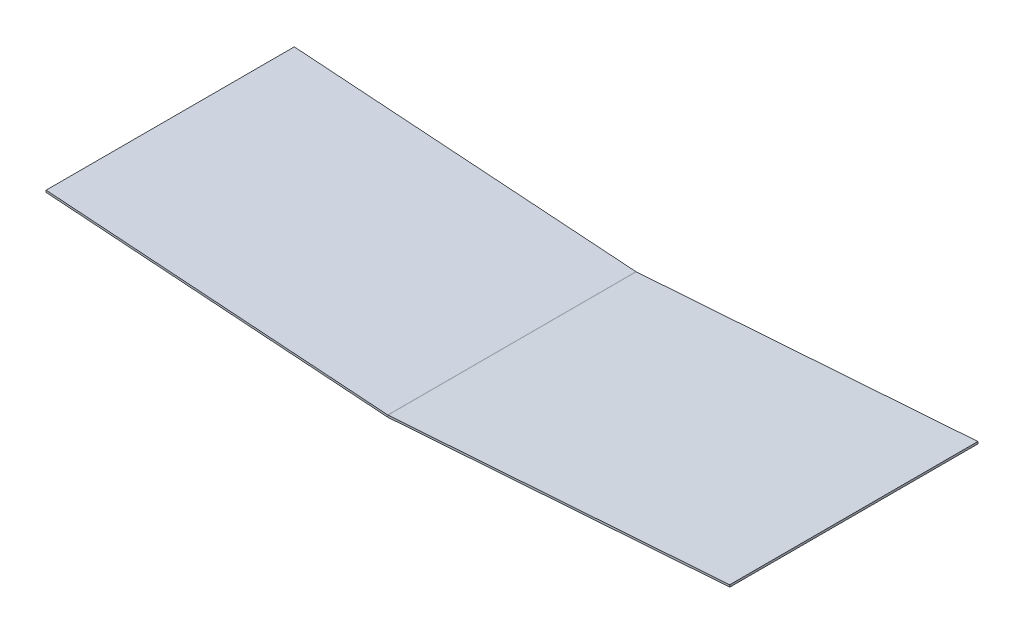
ISO-10303-21;
HEADER;
FILE_DESCRIPTION(('STEP AP214'),'2;1');
FILE_NAME('part.step','',(''),(''),'','','');
FILE_SCHEMA(('AUTOMOTIVE_DESIGN { 1 0 10303 214 1 1 1 1 }'));
ENDSEC;
DATA;
#1=APPLICATION_CONTEXT('core data for automotive mechanical design processes');
#2=APPLICATION_PROTOCOL_DEFINITION('international standard','automotive_design',2000,#1);
#3=PRODUCT_CONTEXT('',#1,'mechanical');
#4=PRODUCT('Part','Part','',(#3));
#5=PRODUCT_RELATED_PRODUCT_CATEGORY('part','',(#4));
#6=PRODUCT_DEFINITION_FORMATION('','',#4);
#7=PRODUCT_DEFINITION_CONTEXT('part definition',#1,'design');
#8=PRODUCT_DEFINITION('design','',#6,#7);
#9=PRODUCT_DEFINITION_SHAPE('','',#8);
#10=(LENGTH_UNIT() NAMED_UNIT(*) SI_UNIT(.MILLI.,.METRE.));
#11=(NAMED_UNIT(*) PLANE_ANGLE_UNIT() SI_UNIT($,.RADIAN.));
#12=(NAMED_UNIT(*) SI_UNIT($,.STERADIAN.) SOLID_ANGLE_UNIT());
#13=UNCERTAINTY_MEASURE_WITH_UNIT(LENGTH_MEASURE(1.E-05),#10,'distance_accuracy_value','');
#14=(GEOMETRIC_REPRESENTATION_CONTEXT(3) GLOBAL_UNCERTAINTY_ASSIGNED_CONTEXT((#13)) GLOBAL_UNIT_ASSIGNED_CONTEXT((#10,
#11,#12)) REPRESENTATION_CONTEXT('',''));
#15=CARTESIAN_POINT('',(0.,0.,0.));
#16=DIRECTION('',(0.,0.,1.));
#17=DIRECTION('',(1.,0.,0.));
#18=AXIS2_PLACEMENT_3D('',#15,#16,#17);
#19=CARTESIAN_POINT('',(-0.885907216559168,0.0619486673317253,785.8125));
#20=DIRECTION('',(0.,0.,1.));
#21=DIRECTION('',(1.,0.,0.));
#22=AXIS2_PLACEMENT_3D('',#19,#20,#21);
#23=PLANE('',#22);
#24=DIRECTION('',(0.0697564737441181,0.997564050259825,0.));
#25=VECTOR('',#24,1.);
#26=CARTESIAN_POINT('',(-0.885907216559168,0.0619486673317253,785.8125));
#27=LINE('',#26,#25);
#28=CARTESIAN_POINT('',(-0.885907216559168,0.0619486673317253,785.8125));
#29=VERTEX_POINT('',#28);
#30=CARTESIAN_POINT('',(-0.442953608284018,6.39648038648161,785.8125));
#31=VERTEX_POINT('',#30);
#32=EDGE_CURVE('E11',#29,#31,#27,.T.);
#33=ORIENTED_EDGE('',*,*,#32,.F.);
#34=CARTESIAN_POINT('',(-8.91029871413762E-12,12.7310121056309,785.8125));
#35=DIRECTION('',(0.,0.,1.));
#36=DIRECTION('',(1.,0.,0.));
#37=AXIS2_PLACEMENT_3D('',#34,#35,#36);
#38=CIRCLE('',#37,12.7);
#39=CARTESIAN_POINT('',(0.885907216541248,0.0619486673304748,785.8125));
#40=VERTEX_POINT('',#39);
#41=EDGE_CURVE('E136',#40,#29,#38,.F.);
#42=ORIENTED_EDGE('',*,*,#41,.F.);
#43=DIRECTION('',(0.0697564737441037,-0.997564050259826,0.));
#44=VECTOR('',#43,1.);
#45=CARTESIAN_POINT('',(0.442953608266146,6.39648038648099,785.8125));
#46=LINE('',#45,#44);
#47=CARTESIAN_POINT('',(0.442953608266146,6.39648038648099,785.8125));
#48=VERTEX_POINT('',#47);
#49=EDGE_CURVE('E47',#48,#40,#46,.T.);
#50=ORIENTED_EDGE('',*,*,#49,.F.);
#51=CARTESIAN_POINT('',(-8.91029871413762E-12,12.7310121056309,785.8125));
#52=DIRECTION('',(0.,0.,-1.));
#53=DIRECTION('',(-1.,0.,0.));
#54=AXIS2_PLACEMENT_3D('',#51,#52,#53);
#55=CIRCLE('',#54,6.35);
#56=EDGE_CURVE('E188',#48,#31,#55,.T.);
#57=ORIENTED_EDGE('',*,*,#56,.T.);
#58=EDGE_LOOP('',(#33,#42,#50,#57));
#59=FACE_BOUND('',#58,.T.);
#60=ADVANCED_FACE('F39',(#59),#23,.T.);
#61=CARTESIAN_POINT('',(0.442953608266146,6.39648038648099,785.8125));
#62=DIRECTION('',(0.,0.,1.));
#63=DIRECTION('',(1.,0.,0.));
#64=AXIS2_PLACEMENT_3D('',#61,#62,#63);
#65=PLANE('',#64);
#66=DIRECTION('',(-0.997564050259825,0.0697564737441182,0.));
#67=VECTOR('',#66,1.);
#68=CARTESIAN_POINT('',(0.,0.,785.8125));
#69=LINE('',#68,#67);
#70=CARTESIAN_POINT('',(-1082.675,75.7080111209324,785.8125));
#71=VERTEX_POINT('',#70);
#72=EDGE_CURVE('E161',#29,#71,#69,.T.);
#73=ORIENTED_EDGE('',*,*,#72,.F.);
#74=ORIENTED_EDGE('',*,*,#32,.T.);
#75=DIRECTION('',(-0.997564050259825,0.0697564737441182,0.));
#76=VECTOR('',#75,1.);
#77=CARTESIAN_POINT('',(0.44295360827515,6.33453171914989,785.8125));
#78=LINE('',#77,#76);
#79=CARTESIAN_POINT('',(-1082.23204639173,82.0425428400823,785.8125));
#80=VERTEX_POINT('',#79);
#81=EDGE_CURVE('E204',#31,#80,#78,.T.);
#82=ORIENTED_EDGE('',*,*,#81,.T.);
#83=DIRECTION('',(-0.0697564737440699,-0.997564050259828,0.));
#84=VECTOR('',#83,1.);
#85=CARTESIAN_POINT('',(-1082.23204639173,82.0425428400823,785.8125));
#86=LINE('',#85,#84);
#87=EDGE_CURVE('E98',#80,#71,#86,.T.);
#88=ORIENTED_EDGE('',*,*,#87,.T.);
#89=EDGE_LOOP('',(#73,#74,#82,#88));
#90=FACE_BOUND('',#89,.T.);
#91=ADVANCED_FACE('F209',(#90),#65,.T.);
#92=CARTESIAN_POINT('',(0.885907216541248,0.0619486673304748,0.));
#93=DIRECTION('',(0.,0.,-1.));
#94=DIRECTION('',(-1.,0.,0.));
#95=AXIS2_PLACEMENT_3D('',#92,#93,#94);
#96=PLANE('',#95);
#97=DIRECTION('',(-0.0697564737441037,0.997564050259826,0.));
#98=VECTOR('',#97,1.);
#99=CARTESIAN_POINT('',(0.885907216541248,0.0619486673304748,0.));
#100=LINE('',#99,#98);
#101=CARTESIAN_POINT('',(0.885907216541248,0.0619486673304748,0.));
#102=VERTEX_POINT('',#101);
#103=CARTESIAN_POINT('',(0.442953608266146,6.39648038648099,0.));
#104=VERTEX_POINT('',#103);
#105=EDGE_CURVE('E82',#102,#104,#100,.T.);
#106=ORIENTED_EDGE('',*,*,#105,.F.);
#107=CARTESIAN_POINT('',(-8.91029871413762E-12,12.7310121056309,0.));
#108=DIRECTION('',(0.,0.,1.));
#109=DIRECTION('',(1.,0.,0.));
#110=AXIS2_PLACEMENT_3D('',#107,#108,#109);
#111=CIRCLE('',#110,12.7);
#112=CARTESIAN_POINT('',(-0.885907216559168,0.0619486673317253,0.));
#113=VERTEX_POINT('',#112);
#114=EDGE_CURVE('E159',#102,#113,#111,.F.);
#115=ORIENTED_EDGE('',*,*,#114,.T.);
#116=DIRECTION('',(-0.0697564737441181,-0.997564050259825,0.));
#117=VECTOR('',#116,1.);
#118=CARTESIAN_POINT('',(-0.442953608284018,6.39648038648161,0.));
#119=LINE('',#118,#117);
#120=CARTESIAN_POINT('',(-0.442953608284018,6.39648038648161,0.));
#121=VERTEX_POINT('',#120);
#122=EDGE_CURVE('E89',#121,#113,#119,.T.);
#123=ORIENTED_EDGE('',*,*,#122,.F.);
#124=CARTESIAN_POINT('',(-8.91029871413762E-12,12.7310121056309,0.));
#125=DIRECTION('',(0.,0.,-1.));
#126=DIRECTION('',(-1.,0.,0.));
#127=AXIS2_PLACEMENT_3D('',#124,#125,#126);
#128=CIRCLE('',#127,6.35);
#129=EDGE_CURVE('E150',#104,#121,#128,.T.);
#130=ORIENTED_EDGE('',*,*,#129,.F.);
#131=EDGE_LOOP('',(#106,#115,#123,#130));
#132=FACE_BOUND('',#131,.T.);
#133=ADVANCED_FACE('F189',(#132),#96,.T.);
#134=CARTESIAN_POINT('',(-0.442953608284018,6.39648038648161,0.));
#135=DIRECTION('',(0.,0.,-1.));
#136=DIRECTION('',(-1.,0.,0.));
#137=AXIS2_PLACEMENT_3D('',#134,#135,#136);
#138=PLANE('',#137);
#139=DIRECTION('',(-0.997564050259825,-0.0697564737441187,0.));
#140=VECTOR('',#139,1.);
#141=CARTESIAN_POINT('',(1082.675,75.7080111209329,0.));
#142=LINE('',#141,#140);
#143=CARTESIAN_POINT('',(1082.675,75.7080111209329,0.));
#144=VERTEX_POINT('',#143);
#145=EDGE_CURVE('E119',#144,#102,#142,.T.);
#146=ORIENTED_EDGE('',*,*,#145,.T.);
#147=ORIENTED_EDGE('',*,*,#105,.T.);
#148=DIRECTION('',(-0.997564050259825,-0.0697564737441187,0.));
#149=VECTOR('',#148,1.);
#150=CARTESIAN_POINT('',(1082.23204639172,82.0425428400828,0.));
#151=LINE('',#150,#149);
#152=CARTESIAN_POINT('',(1082.23204639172,82.0425428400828,0.));
#153=VERTEX_POINT('',#152);
#154=EDGE_CURVE('E153',#153,#104,#151,.T.);
#155=ORIENTED_EDGE('',*,*,#154,.F.);
#156=DIRECTION('',(-0.0697564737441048,0.997564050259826,0.));
#157=VECTOR('',#156,1.);
#158=CARTESIAN_POINT('',(1082.675,75.7080111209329,0.));
#159=LINE('',#158,#157);
#160=EDGE_CURVE('E156',#144,#153,#159,.T.);
#161=ORIENTED_EDGE('',*,*,#160,.F.);
#162=EDGE_LOOP('',(#146,#147,#155,#161));
#163=FACE_BOUND('',#162,.T.);
#164=ADVANCED_FACE('F179',(#163),#138,.T.);
#165=CARTESIAN_POINT('',(0.,0.,785.8125));
#166=DIRECTION('',(-0.0697564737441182,-0.997564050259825,0.));
#167=DIRECTION('',(0.997564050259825,-0.0697564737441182,0.));
#168=AXIS2_PLACEMENT_3D('',#165,#166,#167);
#169=PLANE('',#168);
#170=DIRECTION('',(-0.997564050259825,0.0697564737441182,0.));
#171=VECTOR('',#170,1.);
#172=CARTESIAN_POINT('',(0.,0.,0.));
#173=LINE('',#172,#171);
#174=CARTESIAN_POINT('',(-1082.675,75.7080111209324,0.));
#175=VERTEX_POINT('',#174);
#176=EDGE_CURVE('E143',#113,#175,#173,.T.);
#177=ORIENTED_EDGE('',*,*,#176,.F.);
#178=DIRECTION('',(0.,0.,-1.));
#179=VECTOR('',#178,1.);
#180=CARTESIAN_POINT('',(-0.885907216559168,0.0619486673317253,785.8125));
#181=LINE('',#180,#179);
#182=EDGE_CURVE('E162',#29,#113,#181,.T.);
#183=ORIENTED_EDGE('',*,*,#182,.F.);
#184=ORIENTED_EDGE('',*,*,#72,.T.);
#185=DIRECTION('',(0.,0.,-1.));
#186=VECTOR('',#185,1.);
#187=CARTESIAN_POINT('',(-1082.675,75.7080111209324,785.8125));
#188=LINE('',#187,#186);
#189=EDGE_CURVE('E139',#71,#175,#188,.T.);
#190=ORIENTED_EDGE('',*,*,#189,.T.);
#191=EDGE_LOOP('',(#177,#183,#184,#190));
#192=FACE_BOUND('',#191,.T.);
#193=ADVANCED_FACE('F195',(#192),#169,.T.);
#194=CARTESIAN_POINT('',(-8.91029871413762E-12,12.7310121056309,785.8125));
#195=DIRECTION('',(0.,0.,-1.));
#196=DIRECTION('',(-1.,0.,0.));
#197=AXIS2_PLACEMENT_3D('',#194,#195,#196);
#198=CYLINDRICAL_SURFACE('',#197,12.7);
#199=ORIENTED_EDGE('',*,*,#114,.F.);
#200=DIRECTION('',(0.,0.,-1.));
#201=VECTOR('',#200,1.);
#202=CARTESIAN_POINT('',(0.885907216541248,0.0619486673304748,785.8125));
#203=LINE('',#202,#201);
#204=EDGE_CURVE('E122',#40,#102,#203,.T.);
#205=ORIENTED_EDGE('',*,*,#204,.F.);
#206=ORIENTED_EDGE('',*,*,#41,.T.);
#207=ORIENTED_EDGE('',*,*,#182,.T.);
#208=EDGE_LOOP('',(#199,#205,#206,#207));
#209=FACE_BOUND('',#208,.T.);
#210=ADVANCED_FACE('F191',(#209),#198,.T.);
#211=CARTESIAN_POINT('',(1082.675,75.7080111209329,785.8125));
#212=DIRECTION('',(0.0697564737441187,-0.997564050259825,0.));
#213=DIRECTION('',(0.997564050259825,0.0697564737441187,0.));
#214=AXIS2_PLACEMENT_3D('',#211,#212,#213);
#215=PLANE('',#214);
#216=ORIENTED_EDGE('',*,*,#145,.F.);
#217=DIRECTION('',(0.,0.,-1.));
#218=VECTOR('',#217,1.);
#219=CARTESIAN_POINT('',(1082.675,75.7080111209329,785.8125));
#220=LINE('',#219,#218);
#221=CARTESIAN_POINT('',(1082.675,75.7080111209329,785.8125));
#222=VERTEX_POINT('',#221);
#223=EDGE_CURVE('E113',#222,#144,#220,.T.);
#224=ORIENTED_EDGE('',*,*,#223,.F.);
#225=DIRECTION('',(-0.997564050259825,-0.0697564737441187,0.));
#226=VECTOR('',#225,1.);
#227=CARTESIAN_POINT('',(1082.675,75.7080111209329,785.8125));
#228=LINE('',#227,#226);
#229=EDGE_CURVE('E117',#222,#40,#228,.T.);
#230=ORIENTED_EDGE('',*,*,#229,.T.);
#231=ORIENTED_EDGE('',*,*,#204,.T.);
#232=EDGE_LOOP('',(#216,#224,#230,#231));
#233=FACE_BOUND('',#232,.T.);
#234=ADVANCED_FACE('F115',(#233),#215,.T.);
#235=CARTESIAN_POINT('',(1082.675,75.7080111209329,785.8125));
#236=DIRECTION('',(-0.997564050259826,-0.0697564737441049,0.));
#237=DIRECTION('',(0.0697564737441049,-0.997564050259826,0.));
#238=AXIS2_PLACEMENT_3D('',#235,#236,#237);
#239=PLANE('',#238);
#240=ORIENTED_EDGE('',*,*,#160,.T.);
#241=DIRECTION('',(0.,0.,-1.));
#242=VECTOR('',#241,1.);
#243=CARTESIAN_POINT('',(1082.23204639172,82.0425428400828,785.8125));
#244=LINE('',#243,#242);
#245=CARTESIAN_POINT('',(1082.23204639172,82.0425428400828,785.8125));
#246=VERTEX_POINT('',#245);
#247=EDGE_CURVE('E123',#246,#153,#244,.T.);
#248=ORIENTED_EDGE('',*,*,#247,.F.);
#249=DIRECTION('',(-0.0697564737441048,0.997564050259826,0.));
#250=VECTOR('',#249,1.);
#251=CARTESIAN_POINT('',(1082.675,75.7080111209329,785.8125));
#252=LINE('',#251,#250);
#253=EDGE_CURVE('E126',#222,#246,#252,.T.);
#254=ORIENTED_EDGE('',*,*,#253,.F.);
#255=ORIENTED_EDGE('',*,*,#223,.T.);
#256=EDGE_LOOP('',(#240,#248,#254,#255));
#257=FACE_BOUND('',#256,.T.);
#258=ADVANCED_FACE('F127',(#257),#239,.F.);
#259=CARTESIAN_POINT('',(1082.23204639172,82.0425428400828,785.8125));
#260=DIRECTION('',(0.0697564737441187,-0.997564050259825,0.));
#261=DIRECTION('',(0.997564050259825,0.0697564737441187,0.));
#262=AXIS2_PLACEMENT_3D('',#259,#260,#261);
#263=PLANE('',#262);
#264=ORIENTED_EDGE('',*,*,#154,.T.);
#265=DIRECTION('',(0.,0.,-1.));
#266=VECTOR('',#265,1.);
#267=CARTESIAN_POINT('',(0.442953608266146,6.39648038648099,785.8125));
#268=LINE('',#267,#266);
#269=EDGE_CURVE('E166',#48,#104,#268,.T.);
#270=ORIENTED_EDGE('',*,*,#269,.F.);
#271=DIRECTION('',(-0.997564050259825,-0.0697564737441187,0.));
#272=VECTOR('',#271,1.);
#273=CARTESIAN_POINT('',(1082.23204639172,82.0425428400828,785.8125));
#274=LINE('',#273,#272);
#275=EDGE_CURVE('E132',#246,#48,#274,.T.);
#276=ORIENTED_EDGE('',*,*,#275,.F.);
#277=ORIENTED_EDGE('',*,*,#247,.T.);
#278=EDGE_LOOP('',(#264,#270,#276,#277));
#279=FACE_BOUND('',#278,.T.);
#280=ADVANCED_FACE('F183',(#279),#263,.F.);
#281=CARTESIAN_POINT('',(-8.91029871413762E-12,12.7310121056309,785.8125));
#282=DIRECTION('',(0.,0.,-1.));
#283=DIRECTION('',(-1.,0.,0.));
#284=AXIS2_PLACEMENT_3D('',#281,#282,#283);
#285=CYLINDRICAL_SURFACE('',#284,6.35);
#286=ORIENTED_EDGE('',*,*,#129,.T.);
#287=DIRECTION('',(0.,0.,-1.));
#288=VECTOR('',#287,1.);
#289=CARTESIAN_POINT('',(-0.442953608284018,6.39648038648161,785.8125));
#290=LINE('',#289,#288);
#291=EDGE_CURVE('E169',#31,#121,#290,.T.);
#292=ORIENTED_EDGE('',*,*,#291,.F.);
#293=ORIENTED_EDGE('',*,*,#56,.F.);
#294=ORIENTED_EDGE('',*,*,#269,.T.);
#295=EDGE_LOOP('',(#286,#292,#293,#294));
#296=FACE_BOUND('',#295,.T.);
#297=ADVANCED_FACE('F186',(#296),#285,.F.);
#298=CARTESIAN_POINT('',(0.44295360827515,6.33453171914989,785.8125));
#299=DIRECTION('',(-0.0697564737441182,-0.997564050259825,0.));
#300=DIRECTION('',(0.997564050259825,-0.0697564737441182,0.));
#301=AXIS2_PLACEMENT_3D('',#298,#299,#300);
#302=PLANE('',#301);
#303=DIRECTION('',(-0.997564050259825,0.0697564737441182,0.));
#304=VECTOR('',#303,1.);
#305=CARTESIAN_POINT('',(0.44295360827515,6.33453171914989,0.));
#306=LINE('',#305,#304);
#307=CARTESIAN_POINT('',(-1082.23204639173,82.0425428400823,0.));
#308=VERTEX_POINT('',#307);
#309=EDGE_CURVE('E148',#121,#308,#306,.T.);
#310=ORIENTED_EDGE('',*,*,#309,.T.);
#311=DIRECTION('',(0.,0.,-1.));
#312=VECTOR('',#311,1.);
#313=CARTESIAN_POINT('',(-1082.23204639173,82.0425428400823,785.8125));
#314=LINE('',#313,#312);
#315=EDGE_CURVE('E172',#80,#308,#314,.T.);
#316=ORIENTED_EDGE('',*,*,#315,.F.);
#317=ORIENTED_EDGE('',*,*,#81,.F.);
#318=ORIENTED_EDGE('',*,*,#291,.T.);
#319=EDGE_LOOP('',(#310,#316,#317,#318));
#320=FACE_BOUND('',#319,.T.);
#321=ADVANCED_FACE('F203',(#320),#302,.F.);
#322=CARTESIAN_POINT('',(-1082.23204639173,82.0425428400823,785.8125));
#323=DIRECTION('',(0.997564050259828,-0.0697564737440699,0.));
#324=DIRECTION('',(0.0697564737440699,0.997564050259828,0.));
#325=AXIS2_PLACEMENT_3D('',#322,#323,#324);
#326=PLANE('',#325);
#327=DIRECTION('',(-0.0697564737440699,-0.997564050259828,0.));
#328=VECTOR('',#327,1.);
#329=CARTESIAN_POINT('',(-1082.23204639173,82.0425428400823,0.));
#330=LINE('',#329,#328);
#331=EDGE_CURVE('E145',#308,#175,#330,.T.);
#332=ORIENTED_EDGE('',*,*,#331,.T.);
#333=ORIENTED_EDGE('',*,*,#189,.F.);
#334=ORIENTED_EDGE('',*,*,#87,.F.);
#335=ORIENTED_EDGE('',*,*,#315,.T.);
#336=EDGE_LOOP('',(#332,#333,#334,#335));
#337=FACE_BOUND('',#336,.T.);
#338=ADVANCED_FACE('F199',(#337),#326,.F.);
#339=CARTESIAN_POINT('',(-8.91029871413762E-12,12.7310121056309,785.8125));
#340=DIRECTION('',(0.,0.,-1.));
#341=DIRECTION('',(-1.,0.,0.));
#342=AXIS2_PLACEMENT_3D('',#339,#340,#341);
#343=PLANE('',#342);
#344=ORIENTED_EDGE('',*,*,#275,.T.);
#345=ORIENTED_EDGE('',*,*,#49,.T.);
#346=ORIENTED_EDGE('',*,*,#229,.F.);
#347=ORIENTED_EDGE('',*,*,#253,.T.);
#348=EDGE_LOOP('',(#344,#345,#346,#347));
#349=FACE_BOUND('',#348,.T.);
#350=ADVANCED_FACE('F134',(#349),#343,.F.);
#351=CARTESIAN_POINT('',(-8.91029871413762E-12,12.7310121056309,0.));
#352=DIRECTION('',(0.,0.,-1.));
#353=DIRECTION('',(-1.,0.,0.));
#354=AXIS2_PLACEMENT_3D('',#351,#352,#353);
#355=PLANE('',#354);
#356=ORIENTED_EDGE('',*,*,#176,.T.);
#357=ORIENTED_EDGE('',*,*,#331,.F.);
#358=ORIENTED_EDGE('',*,*,#309,.F.);
#359=ORIENTED_EDGE('',*,*,#122,.T.);
#360=EDGE_LOOP('',(#356,#357,#358,#359));
#361=FACE_BOUND('',#360,.T.);
#362=ADVANCED_FACE('F197',(#361),#355,.T.);
#363=CLOSED_SHELL('',(#60,#91,#133,#164,#193,#210,#234,#258,#280,#297,#321,#338,#350,#362));
#364=MANIFOLD_SOLID_BREP('B2',#363);
#365=ADVANCED_BREP_SHAPE_REPRESENTATION('',(#18,#364),#14);
#366=SHAPE_DEFINITION_REPRESENTATION(#9,#365);
ENDSEC;
END-ISO-10303-21;
